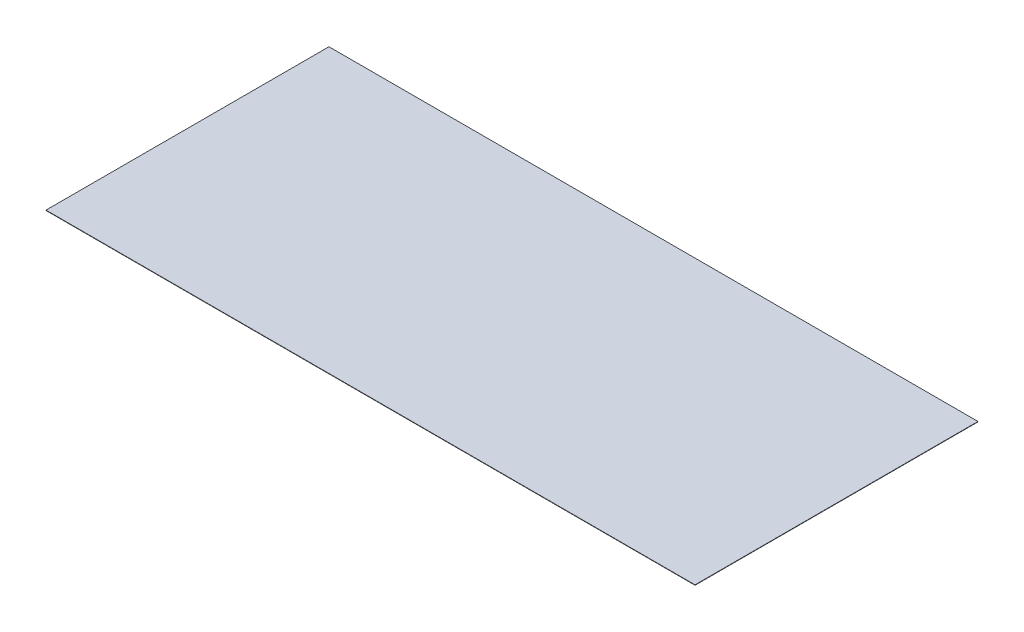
ISO-10303-21;
HEADER;
FILE_DESCRIPTION(('STEP AP214'),'2;1');
FILE_NAME('part.step','',(''),(''),'','','');
FILE_SCHEMA(('AUTOMOTIVE_DESIGN { 1 0 10303 214 1 1 1 1 }'));
ENDSEC;
DATA;
#1=APPLICATION_CONTEXT('core data for automotive mechanical design processes');
#2=APPLICATION_PROTOCOL_DEFINITION('international standard','automotive_design',2000,#1);
#3=PRODUCT_CONTEXT('',#1,'mechanical');
#4=PRODUCT('Part','Part','',(#3));
#5=PRODUCT_RELATED_PRODUCT_CATEGORY('part','',(#4));
#6=PRODUCT_DEFINITION_FORMATION('','',#4);
#7=PRODUCT_DEFINITION_CONTEXT('part definition',#1,'design');
#8=PRODUCT_DEFINITION('design','',#6,#7);
#9=PRODUCT_DEFINITION_SHAPE('','',#8);
#10=(LENGTH_UNIT() NAMED_UNIT(*) SI_UNIT(.MILLI.,.METRE.));
#11=(NAMED_UNIT(*) PLANE_ANGLE_UNIT() SI_UNIT($,.RADIAN.));
#12=(NAMED_UNIT(*) SI_UNIT($,.STERADIAN.) SOLID_ANGLE_UNIT());
#13=UNCERTAINTY_MEASURE_WITH_UNIT(LENGTH_MEASURE(1.E-05),#10,'distance_accuracy_value','');
#14=(GEOMETRIC_REPRESENTATION_CONTEXT(3) GLOBAL_UNCERTAINTY_ASSIGNED_CONTEXT((#13)) GLOBAL_UNIT_ASSIGNED_CONTEXT((#10,
#11,#12)) REPRESENTATION_CONTEXT('',''));
#15=CARTESIAN_POINT('',(0.,0.,0.));
#16=DIRECTION('',(0.,0.,1.));
#17=DIRECTION('',(1.,0.,0.));
#18=AXIS2_PLACEMENT_3D('',#15,#16,#17);
#19=CARTESIAN_POINT('',(0.,0.05,0.));
#20=DIRECTION('',(1.,0.,0.));
#21=DIRECTION('',(0.,0.,-1.));
#22=AXIS2_PLACEMENT_3D('',#19,#20,#21);
#23=PLANE('',#22);
#24=DIRECTION('',(0.,0.,1.));
#25=VECTOR('',#24,1.);
#26=CARTESIAN_POINT('',(0.,0.,0.));
#27=LINE('',#26,#25);
#28=CARTESIAN_POINT('',(0.,0.,-37.1));
#29=VERTEX_POINT('',#28);
#30=CARTESIAN_POINT('',(0.,0.,0.));
#31=VERTEX_POINT('',#30);
#32=EDGE_CURVE('E95',#29,#31,#27,.T.);
#33=ORIENTED_EDGE('',*,*,#32,.T.);
#34=DIRECTION('',(0.,-1.,0.));
#35=VECTOR('',#34,1.);
#36=CARTESIAN_POINT('',(0.,0.05,0.));
#37=LINE('',#36,#35);
#38=CARTESIAN_POINT('',(0.,0.05,0.));
#39=VERTEX_POINT('',#38);
#40=EDGE_CURVE('E11',#39,#31,#37,.T.);
#41=ORIENTED_EDGE('',*,*,#40,.F.);
#42=DIRECTION('',(0.,0.,1.));
#43=VECTOR('',#42,1.);
#44=CARTESIAN_POINT('',(0.,0.05,0.));
#45=LINE('',#44,#43);
#46=CARTESIAN_POINT('',(0.,0.05,-37.1));
#47=VERTEX_POINT('',#46);
#48=EDGE_CURVE('E83',#47,#39,#45,.T.);
#49=ORIENTED_EDGE('',*,*,#48,.F.);
#50=DIRECTION('',(0.,-1.,0.));
#51=VECTOR('',#50,1.);
#52=CARTESIAN_POINT('',(0.,0.05,-37.1));
#53=LINE('',#52,#51);
#54=EDGE_CURVE('E91',#47,#29,#53,.T.);
#55=ORIENTED_EDGE('',*,*,#54,.T.);
#56=EDGE_LOOP('',(#33,#41,#49,#55));
#57=FACE_BOUND('',#56,.T.);
#58=ADVANCED_FACE('F32',(#57),#23,.F.);
#59=CARTESIAN_POINT('',(0.,0.05,0.));
#60=DIRECTION('',(0.,0.,-1.));
#61=DIRECTION('',(-1.,0.,0.));
#62=AXIS2_PLACEMENT_3D('',#59,#60,#61);
#63=PLANE('',#62);
#64=DIRECTION('',(1.,0.,0.));
#65=VECTOR('',#64,1.);
#66=CARTESIAN_POINT('',(0.,0.,0.));
#67=LINE('',#66,#65);
#68=CARTESIAN_POINT('',(85.1,0.,0.));
#69=VERTEX_POINT('',#68);
#70=EDGE_CURVE('E87',#31,#69,#67,.T.);
#71=ORIENTED_EDGE('',*,*,#70,.T.);
#72=DIRECTION('',(0.,-1.,0.));
#73=VECTOR('',#72,1.);
#74=CARTESIAN_POINT('',(85.1,0.05,0.));
#75=LINE('',#74,#73);
#76=CARTESIAN_POINT('',(85.1,0.05,0.));
#77=VERTEX_POINT('',#76);
#78=EDGE_CURVE('E40',#77,#69,#75,.T.);
#79=ORIENTED_EDGE('',*,*,#78,.F.);
#80=DIRECTION('',(1.,0.,0.));
#81=VECTOR('',#80,1.);
#82=CARTESIAN_POINT('',(0.,0.05,0.));
#83=LINE('',#82,#81);
#84=EDGE_CURVE('E78',#39,#77,#83,.T.);
#85=ORIENTED_EDGE('',*,*,#84,.F.);
#86=ORIENTED_EDGE('',*,*,#40,.T.);
#87=EDGE_LOOP('',(#71,#79,#85,#86));
#88=FACE_BOUND('',#87,.T.);
#89=ADVANCED_FACE('F86',(#88),#63,.F.);
#90=CARTESIAN_POINT('',(85.1,0.05,0.));
#91=DIRECTION('',(-1.,0.,0.));
#92=DIRECTION('',(0.,0.,1.));
#93=AXIS2_PLACEMENT_3D('',#90,#91,#92);
#94=PLANE('',#93);
#95=DIRECTION('',(0.,0.,-1.));
#96=VECTOR('',#95,1.);
#97=CARTESIAN_POINT('',(85.1,0.,0.));
#98=LINE('',#97,#96);
#99=CARTESIAN_POINT('',(85.1,0.,-37.1));
#100=VERTEX_POINT('',#99);
#101=EDGE_CURVE('E65',#69,#100,#98,.T.);
#102=ORIENTED_EDGE('',*,*,#101,.T.);
#103=DIRECTION('',(0.,-1.,0.));
#104=VECTOR('',#103,1.);
#105=CARTESIAN_POINT('',(85.1,0.05,-37.1));
#106=LINE('',#105,#104);
#107=CARTESIAN_POINT('',(85.1,0.05,-37.1));
#108=VERTEX_POINT('',#107);
#109=EDGE_CURVE('E88',#108,#100,#106,.T.);
#110=ORIENTED_EDGE('',*,*,#109,.F.);
#111=DIRECTION('',(0.,0.,-1.));
#112=VECTOR('',#111,1.);
#113=CARTESIAN_POINT('',(85.1,0.05,0.));
#114=LINE('',#113,#112);
#115=EDGE_CURVE('E81',#77,#108,#114,.T.);
#116=ORIENTED_EDGE('',*,*,#115,.F.);
#117=ORIENTED_EDGE('',*,*,#78,.T.);
#118=EDGE_LOOP('',(#102,#110,#116,#117));
#119=FACE_BOUND('',#118,.T.);
#120=ADVANCED_FACE('F89',(#119),#94,.F.);
#121=CARTESIAN_POINT('',(0.,0.05,-37.1));
#122=DIRECTION('',(0.,0.,1.));
#123=DIRECTION('',(1.,0.,0.));
#124=AXIS2_PLACEMENT_3D('',#121,#122,#123);
#125=PLANE('',#124);
#126=DIRECTION('',(-1.,0.,0.));
#127=VECTOR('',#126,1.);
#128=CARTESIAN_POINT('',(0.,0.,-37.1));
#129=LINE('',#128,#127);
#130=EDGE_CURVE('E71',#100,#29,#129,.T.);
#131=ORIENTED_EDGE('',*,*,#130,.T.);
#132=ORIENTED_EDGE('',*,*,#54,.F.);
#133=DIRECTION('',(-1.,0.,0.));
#134=VECTOR('',#133,1.);
#135=CARTESIAN_POINT('',(0.,0.05,-37.1));
#136=LINE('',#135,#134);
#137=EDGE_CURVE('E48',#108,#47,#136,.T.);
#138=ORIENTED_EDGE('',*,*,#137,.F.);
#139=ORIENTED_EDGE('',*,*,#109,.T.);
#140=EDGE_LOOP('',(#131,#132,#138,#139));
#141=FACE_BOUND('',#140,.T.);
#142=ADVANCED_FACE('F102',(#141),#125,.F.);
#143=CARTESIAN_POINT('',(0.,0.05,0.));
#144=DIRECTION('',(0.,-1.,0.));
#145=DIRECTION('',(0.,0.,-1.));
#146=AXIS2_PLACEMENT_3D('',#143,#144,#145);
#147=PLANE('',#146);
#148=ORIENTED_EDGE('',*,*,#48,.T.);
#149=ORIENTED_EDGE('',*,*,#84,.T.);
#150=ORIENTED_EDGE('',*,*,#115,.T.);
#151=ORIENTED_EDGE('',*,*,#137,.T.);
#152=EDGE_LOOP('',(#148,#149,#150,#151));
#153=FACE_BOUND('',#152,.T.);
#154=ADVANCED_FACE('F79',(#153),#147,.F.);
#155=CARTESIAN_POINT('',(0.,0.,0.));
#156=DIRECTION('',(0.,-1.,0.));
#157=DIRECTION('',(0.,0.,-1.));
#158=AXIS2_PLACEMENT_3D('',#155,#156,#157);
#159=PLANE('',#158);
#160=ORIENTED_EDGE('',*,*,#32,.F.);
#161=ORIENTED_EDGE('',*,*,#130,.F.);
#162=ORIENTED_EDGE('',*,*,#101,.F.);
#163=ORIENTED_EDGE('',*,*,#70,.F.);
#164=EDGE_LOOP('',(#160,#161,#162,#163));
#165=FACE_BOUND('',#164,.T.);
#166=ADVANCED_FACE('F105',(#165),#159,.T.);
#167=CLOSED_SHELL('',(#58,#89,#120,#142,#154,#166));
#168=MANIFOLD_SOLID_BREP('B2',#167);
#169=ADVANCED_BREP_SHAPE_REPRESENTATION('',(#18,#168),#14);
#170=SHAPE_DEFINITION_REPRESENTATION(#9,#169);
ENDSEC;
END-ISO-10303-21;
